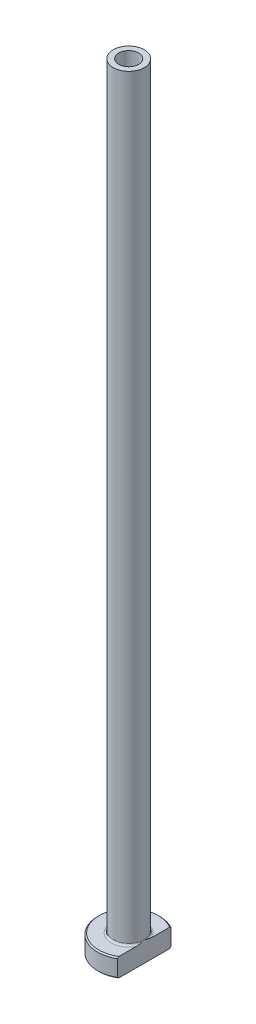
from build123d import *

# Parameters (mm, degrees)
FILLET1_R          = 0.3
CHAMFER1_SIZE      = 0.2
CUT_EXTRUDE1_DEPTH = 126.199840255
CHAMFER2_SIZE      = 0.5


with BuildPart() as part:
    # Sketch1 → Revolve1 (revolve)
    with BuildSketch(Plane.XY, mode=Mode.PRIVATE) as revolve1_sk:
        Polygon((-1.6, 125), (-2.5, 125), (-2.5, 3), (-5, 3), (-5, 0), (-1.85, 0), (-1.85, 68), (-1.6, 80), align=None)
    revolve(revolve1_sk.sketch.rotate(Axis((0, 92.187680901, 0), (0, -1, 0)), 270), axis=Axis((0, 92.187680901, 0), (0, -1, 0)))

    # Fillet1
    fillet1_edges = [part.edges().sort_by_distance(p)[0] for p in [
        (0, 3, -2.5),
    ]]
    fillet(fillet1_edges, radius=FILLET1_R)

    # Chamfer1
    chamfer1_edges = [part.edges().sort_by_distance(p)[0] for p in [
        (0, 0, -5),
        (0, 3, -5),
    ]]
    chamfer(chamfer1_edges, length=CHAMFER1_SIZE)

    # Sketch2 → Cut-Extrude1 (cut, through all)
    with BuildSketch(Plane.XZ):
        with BuildLine():
            Line((2.5, 4.330127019), (2.5, -4.330127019))
            ThreePointArc((2.5, -4.330127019), (5, 0), (2.5, 4.330127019))
        make_face()
    extrude(amount=-CUT_EXTRUDE1_DEPTH, mode=Mode.SUBTRACT)

    # Chamfer2
    chamfer2_edges = [part.edges().sort_by_distance(p)[0] for p in [
        (0, 0, -1.85),
    ]]
    chamfer(chamfer2_edges, length=CHAMFER2_SIZE)


solid = part.part
